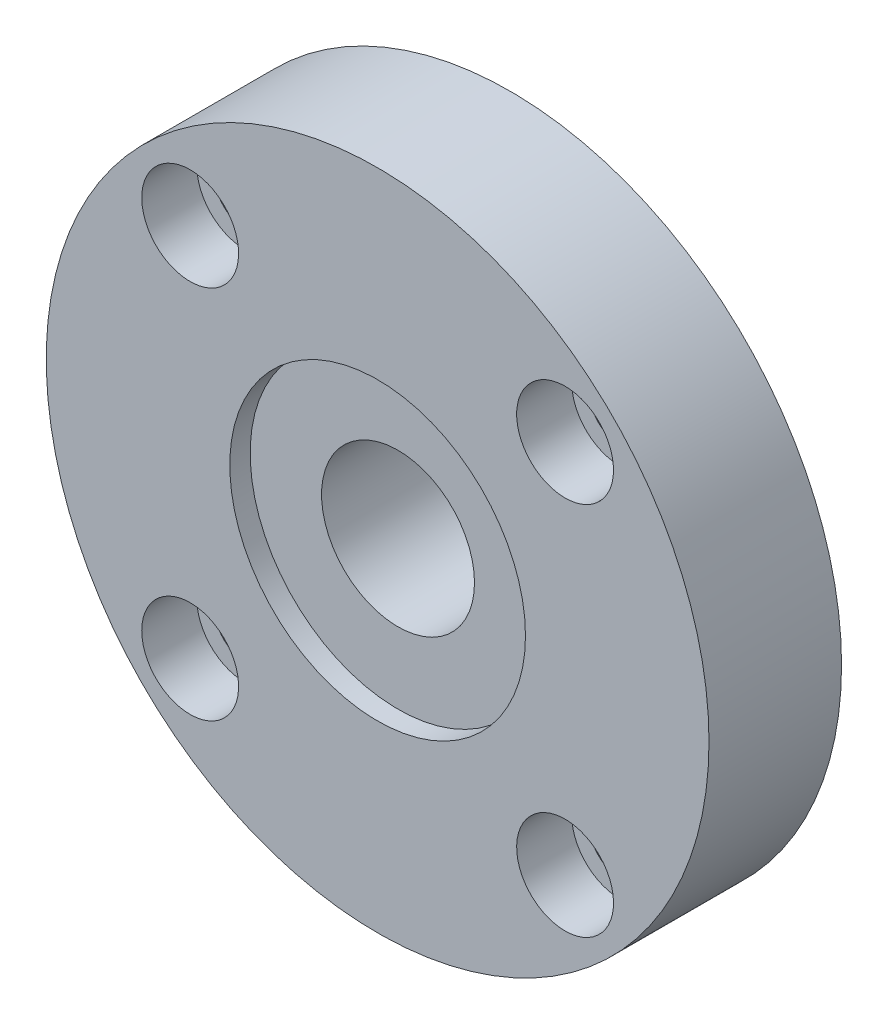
ISO-10303-21;
HEADER;
FILE_DESCRIPTION(('STEP AP214'),'2;1');
FILE_NAME('part.step','',(''),(''),'','','');
FILE_SCHEMA(('AUTOMOTIVE_DESIGN { 1 0 10303 214 1 1 1 1 }'));
ENDSEC;
DATA;
#1=APPLICATION_CONTEXT('core data for automotive mechanical design processes');
#2=APPLICATION_PROTOCOL_DEFINITION('international standard','automotive_design',2000,#1);
#3=PRODUCT_CONTEXT('',#1,'mechanical');
#4=PRODUCT('Part','Part','',(#3));
#5=PRODUCT_RELATED_PRODUCT_CATEGORY('part','',(#4));
#6=PRODUCT_DEFINITION_FORMATION('','',#4);
#7=PRODUCT_DEFINITION_CONTEXT('part definition',#1,'design');
#8=PRODUCT_DEFINITION('design','',#6,#7);
#9=PRODUCT_DEFINITION_SHAPE('','',#8);
#10=(LENGTH_UNIT() NAMED_UNIT(*) SI_UNIT(.MILLI.,.METRE.));
#11=(NAMED_UNIT(*) PLANE_ANGLE_UNIT() SI_UNIT($,.RADIAN.));
#12=(NAMED_UNIT(*) SI_UNIT($,.STERADIAN.) SOLID_ANGLE_UNIT());
#13=UNCERTAINTY_MEASURE_WITH_UNIT(LENGTH_MEASURE(1.E-05),#10,'distance_accuracy_value','');
#14=(GEOMETRIC_REPRESENTATION_CONTEXT(3) GLOBAL_UNCERTAINTY_ASSIGNED_CONTEXT((#13)) GLOBAL_UNIT_ASSIGNED_CONTEXT((#10,
#11,#12)) REPRESENTATION_CONTEXT('',''));
#15=CARTESIAN_POINT('',(0.,0.,0.));
#16=DIRECTION('',(0.,0.,1.));
#17=DIRECTION('',(1.,0.,0.));
#18=AXIS2_PLACEMENT_3D('',#15,#16,#17);
#19=CARTESIAN_POINT('',(0.,0.,13.));
#20=DIRECTION('',(0.,0.,-1.));
#21=DIRECTION('',(-1.,0.,0.));
#22=AXIS2_PLACEMENT_3D('',#19,#20,#21);
#23=CYLINDRICAL_SURFACE('',#22,7.5);
#24=CARTESIAN_POINT('',(0.,0.,0.));
#25=DIRECTION('',(0.,0.,1.));
#26=DIRECTION('',(1.,0.,0.));
#27=AXIS2_PLACEMENT_3D('',#24,#25,#26);
#28=CIRCLE('',#27,7.5);
#29=CARTESIAN_POINT('',(7.5,0.,0.));
#30=VERTEX_POINT('',#29);
#31=EDGE_CURVE('E25',#30,#30,#28,.T.);
#32=ORIENTED_EDGE('',*,*,#31,.F.);
#33=EDGE_LOOP('',(#32));
#34=FACE_BOUND('',#33,.T.);
#35=CARTESIAN_POINT('',(0.,0.,11.));
#36=DIRECTION('',(0.,0.,1.));
#37=DIRECTION('',(1.,0.,0.));
#38=AXIS2_PLACEMENT_3D('',#35,#36,#37);
#39=CIRCLE('',#38,7.5);
#40=CARTESIAN_POINT('',(7.5,0.,11.));
#41=VERTEX_POINT('',#40);
#42=EDGE_CURVE('E16',#41,#41,#39,.T.);
#43=ORIENTED_EDGE('',*,*,#42,.T.);
#44=EDGE_LOOP('',(#43));
#45=FACE_BOUND('',#44,.T.);
#46=ADVANCED_FACE('F12',(#34,#45),#23,.F.);
#47=CARTESIAN_POINT('',(-18.38477631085,18.3847763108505,0.));
#48=DIRECTION('',(0.,0.,1.));
#49=DIRECTION('',(1.,0.,0.));
#50=AXIS2_PLACEMENT_3D('',#47,#48,#49);
#51=CYLINDRICAL_SURFACE('',#50,3.);
#52=CARTESIAN_POINT('',(-18.38477631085,18.3847763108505,0.));
#53=DIRECTION('',(0.,0.,1.));
#54=DIRECTION('',(0.,1.,0.));
#55=AXIS2_PLACEMENT_3D('',#52,#53,#54);
#56=CIRCLE('',#55,3.);
#57=CARTESIAN_POINT('',(-18.38477631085,21.3847763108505,0.));
#58=VERTEX_POINT('',#57);
#59=EDGE_CURVE('E37',#58,#58,#56,.T.);
#60=ORIENTED_EDGE('',*,*,#59,.F.);
#61=EDGE_LOOP('',(#60));
#62=FACE_BOUND('',#61,.T.);
#63=CARTESIAN_POINT('',(-18.38477631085,18.3847763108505,7.6));
#64=DIRECTION('',(0.,0.,1.));
#65=DIRECTION('',(1.,0.,0.));
#66=AXIS2_PLACEMENT_3D('',#63,#64,#65);
#67=CIRCLE('',#66,3.);
#68=CARTESIAN_POINT('',(-15.38477631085,18.3847763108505,7.6));
#69=VERTEX_POINT('',#68);
#70=EDGE_CURVE('E43',#69,#69,#67,.F.);
#71=ORIENTED_EDGE('',*,*,#70,.F.);
#72=EDGE_LOOP('',(#71));
#73=FACE_BOUND('',#72,.T.);
#74=ADVANCED_FACE('F87',(#62,#73),#51,.F.);
#75=CARTESIAN_POINT('',(-18.3847763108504,-18.3847763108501,0.));
#76=DIRECTION('',(0.,0.,1.));
#77=DIRECTION('',(1.,0.,0.));
#78=AXIS2_PLACEMENT_3D('',#75,#76,#77);
#79=CYLINDRICAL_SURFACE('',#78,3.);
#80=CARTESIAN_POINT('',(-18.3847763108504,-18.3847763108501,0.));
#81=DIRECTION('',(0.,0.,1.));
#82=DIRECTION('',(-1.,0.,0.));
#83=AXIS2_PLACEMENT_3D('',#80,#81,#82);
#84=CIRCLE('',#83,3.);
#85=CARTESIAN_POINT('',(-21.3847763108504,-18.3847763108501,0.));
#86=VERTEX_POINT('',#85);
#87=EDGE_CURVE('E68',#86,#86,#84,.T.);
#88=ORIENTED_EDGE('',*,*,#87,.F.);
#89=EDGE_LOOP('',(#88));
#90=FACE_BOUND('',#89,.T.);
#91=CARTESIAN_POINT('',(-18.3847763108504,-18.3847763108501,7.6));
#92=DIRECTION('',(0.,0.,1.));
#93=DIRECTION('',(1.,0.,0.));
#94=AXIS2_PLACEMENT_3D('',#91,#92,#93);
#95=CIRCLE('',#94,3.);
#96=CARTESIAN_POINT('',(-15.3847763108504,-18.3847763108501,7.6));
#97=VERTEX_POINT('',#96);
#98=EDGE_CURVE('E39',#97,#97,#95,.F.);
#99=ORIENTED_EDGE('',*,*,#98,.F.);
#100=EDGE_LOOP('',(#99));
#101=FACE_BOUND('',#100,.T.);
#102=ADVANCED_FACE('F160',(#90,#101),#79,.F.);
#103=CARTESIAN_POINT('',(18.3847763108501,-18.3847763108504,0.));
#104=DIRECTION('',(0.,0.,1.));
#105=DIRECTION('',(1.,0.,0.));
#106=AXIS2_PLACEMENT_3D('',#103,#104,#105);
#107=CYLINDRICAL_SURFACE('',#106,3.);
#108=CARTESIAN_POINT('',(18.3847763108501,-18.3847763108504,0.));
#109=DIRECTION('',(0.,0.,1.));
#110=DIRECTION('',(0.,-1.,0.));
#111=AXIS2_PLACEMENT_3D('',#108,#109,#110);
#112=CIRCLE('',#111,3.);
#113=CARTESIAN_POINT('',(18.3847763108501,-21.3847763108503,0.));
#114=VERTEX_POINT('',#113);
#115=EDGE_CURVE('E71',#114,#114,#112,.T.);
#116=ORIENTED_EDGE('',*,*,#115,.F.);
#117=EDGE_LOOP('',(#116));
#118=FACE_BOUND('',#117,.T.);
#119=CARTESIAN_POINT('',(18.3847763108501,-18.3847763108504,7.6));
#120=DIRECTION('',(0.,0.,1.));
#121=DIRECTION('',(1.,0.,0.));
#122=AXIS2_PLACEMENT_3D('',#119,#120,#121);
#123=CIRCLE('',#122,3.);
#124=CARTESIAN_POINT('',(21.3847763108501,-18.3847763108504,7.6));
#125=VERTEX_POINT('',#124);
#126=EDGE_CURVE('E34',#125,#125,#123,.F.);
#127=ORIENTED_EDGE('',*,*,#126,.F.);
#128=EDGE_LOOP('',(#127));
#129=FACE_BOUND('',#128,.T.);
#130=ADVANCED_FACE('F135',(#118,#129),#107,.F.);
#131=CARTESIAN_POINT('',(18.3847763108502,18.3847763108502,0.));
#132=DIRECTION('',(0.,0.,1.));
#133=DIRECTION('',(1.,0.,0.));
#134=AXIS2_PLACEMENT_3D('',#131,#132,#133);
#135=CYLINDRICAL_SURFACE('',#134,3.);
#136=CARTESIAN_POINT('',(18.3847763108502,18.3847763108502,0.));
#137=DIRECTION('',(0.,0.,1.));
#138=DIRECTION('',(1.,0.,0.));
#139=AXIS2_PLACEMENT_3D('',#136,#137,#138);
#140=CIRCLE('',#139,3.);
#141=CARTESIAN_POINT('',(21.3847763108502,18.3847763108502,0.));
#142=VERTEX_POINT('',#141);
#143=EDGE_CURVE('E32',#142,#142,#140,.T.);
#144=ORIENTED_EDGE('',*,*,#143,.F.);
#145=EDGE_LOOP('',(#144));
#146=FACE_BOUND('',#145,.T.);
#147=CARTESIAN_POINT('',(18.3847763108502,18.3847763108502,7.6));
#148=DIRECTION('',(0.,0.,1.));
#149=DIRECTION('',(1.,0.,0.));
#150=AXIS2_PLACEMENT_3D('',#147,#148,#149);
#151=CIRCLE('',#150,3.);
#152=CARTESIAN_POINT('',(21.3847763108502,18.3847763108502,7.6));
#153=VERTEX_POINT('',#152);
#154=EDGE_CURVE('E29',#153,#153,#151,.F.);
#155=ORIENTED_EDGE('',*,*,#154,.F.);
#156=EDGE_LOOP('',(#155));
#157=FACE_BOUND('',#156,.T.);
#158=ADVANCED_FACE('F106',(#146,#157),#135,.F.);
#159=CARTESIAN_POINT('',(0.,0.,13.));
#160=DIRECTION('',(0.,0.,1.));
#161=DIRECTION('',(1.,0.,0.));
#162=AXIS2_PLACEMENT_3D('',#159,#160,#161);
#163=PLANE('',#162);
#164=CARTESIAN_POINT('',(0.,0.,13.));
#165=DIRECTION('',(0.,0.,1.));
#166=DIRECTION('',(1.,0.,0.));
#167=AXIS2_PLACEMENT_3D('',#164,#165,#166);
#168=CIRCLE('',#167,14.5);
#169=CARTESIAN_POINT('',(14.5,0.,13.));
#170=VERTEX_POINT('',#169);
#171=EDGE_CURVE('E94',#170,#170,#168,.T.);
#172=ORIENTED_EDGE('',*,*,#171,.F.);
#173=EDGE_LOOP('',(#172));
#174=FACE_BOUND('',#173,.T.);
#175=CARTESIAN_POINT('',(-18.38477631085,18.3847763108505,13.));
#176=DIRECTION('',(0.,0.,1.));
#177=DIRECTION('',(0.,1.,0.));
#178=AXIS2_PLACEMENT_3D('',#175,#176,#177);
#179=CIRCLE('',#178,4.75);
#180=CARTESIAN_POINT('',(-18.38477631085,23.1347763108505,13.));
#181=VERTEX_POINT('',#180);
#182=EDGE_CURVE('E52',#181,#181,#179,.T.);
#183=ORIENTED_EDGE('',*,*,#182,.F.);
#184=EDGE_LOOP('',(#183));
#185=FACE_BOUND('',#184,.T.);
#186=CARTESIAN_POINT('',(-18.3847763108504,-18.3847763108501,13.));
#187=DIRECTION('',(0.,0.,1.));
#188=DIRECTION('',(-1.,0.,0.));
#189=AXIS2_PLACEMENT_3D('',#186,#187,#188);
#190=CIRCLE('',#189,4.75);
#191=CARTESIAN_POINT('',(-23.1347763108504,-18.3847763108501,13.));
#192=VERTEX_POINT('',#191);
#193=EDGE_CURVE('E45',#192,#192,#190,.T.);
#194=ORIENTED_EDGE('',*,*,#193,.F.);
#195=EDGE_LOOP('',(#194));
#196=FACE_BOUND('',#195,.T.);
#197=CARTESIAN_POINT('',(18.3847763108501,-18.3847763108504,13.));
#198=DIRECTION('',(0.,0.,1.));
#199=DIRECTION('',(0.,-1.,0.));
#200=AXIS2_PLACEMENT_3D('',#197,#198,#199);
#201=CIRCLE('',#200,4.75);
#202=CARTESIAN_POINT('',(18.3847763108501,-23.1347763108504,13.));
#203=VERTEX_POINT('',#202);
#204=EDGE_CURVE('E41',#203,#203,#201,.T.);
#205=ORIENTED_EDGE('',*,*,#204,.F.);
#206=EDGE_LOOP('',(#205));
#207=FACE_BOUND('',#206,.T.);
#208=CARTESIAN_POINT('',(18.3847763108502,18.3847763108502,13.));
#209=DIRECTION('',(0.,0.,1.));
#210=DIRECTION('',(1.,0.,0.));
#211=AXIS2_PLACEMENT_3D('',#208,#209,#210);
#212=CIRCLE('',#211,4.75);
#213=CARTESIAN_POINT('',(23.1347763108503,18.3847763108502,13.));
#214=VERTEX_POINT('',#213);
#215=EDGE_CURVE('E74',#214,#214,#212,.T.);
#216=ORIENTED_EDGE('',*,*,#215,.F.);
#217=EDGE_LOOP('',(#216));
#218=FACE_BOUND('',#217,.T.);
#219=CARTESIAN_POINT('',(0.,0.,13.));
#220=DIRECTION('',(0.,0.,1.));
#221=DIRECTION('',(1.,0.,0.));
#222=AXIS2_PLACEMENT_3D('',#219,#220,#221);
#223=CIRCLE('',#222,32.5);
#224=CARTESIAN_POINT('',(32.5,0.,13.));
#225=VERTEX_POINT('',#224);
#226=EDGE_CURVE('E8',#225,#225,#223,.T.);
#227=ORIENTED_EDGE('',*,*,#226,.T.);
#228=EDGE_LOOP('',(#227));
#229=FACE_BOUND('',#228,.T.);
#230=ADVANCED_FACE('F103',(#174,#185,#196,#207,#218,#229),#163,.T.);
#231=CARTESIAN_POINT('',(0.,0.,0.));
#232=DIRECTION('',(0.,0.,1.));
#233=DIRECTION('',(1.,0.,0.));
#234=AXIS2_PLACEMENT_3D('',#231,#232,#233);
#235=PLANE('',#234);
#236=ORIENTED_EDGE('',*,*,#59,.T.);
#237=EDGE_LOOP('',(#236));
#238=FACE_BOUND('',#237,.T.);
#239=ORIENTED_EDGE('',*,*,#87,.T.);
#240=EDGE_LOOP('',(#239));
#241=FACE_BOUND('',#240,.T.);
#242=ORIENTED_EDGE('',*,*,#115,.T.);
#243=EDGE_LOOP('',(#242));
#244=FACE_BOUND('',#243,.T.);
#245=ORIENTED_EDGE('',*,*,#143,.T.);
#246=EDGE_LOOP('',(#245));
#247=FACE_BOUND('',#246,.T.);
#248=CARTESIAN_POINT('',(0.,0.,0.));
#249=DIRECTION('',(0.,0.,1.));
#250=DIRECTION('',(1.,0.,0.));
#251=AXIS2_PLACEMENT_3D('',#248,#249,#250);
#252=CIRCLE('',#251,32.5);
#253=CARTESIAN_POINT('',(32.5,0.,0.));
#254=VERTEX_POINT('',#253);
#255=EDGE_CURVE('E20',#254,#254,#252,.T.);
#256=ORIENTED_EDGE('',*,*,#255,.F.);
#257=EDGE_LOOP('',(#256));
#258=FACE_BOUND('',#257,.T.);
#259=ORIENTED_EDGE('',*,*,#31,.T.);
#260=EDGE_LOOP('',(#259));
#261=FACE_BOUND('',#260,.T.);
#262=ADVANCED_FACE('F83',(#238,#241,#244,#247,#258,#261),#235,.F.);
#263=CARTESIAN_POINT('',(0.,0.,13.));
#264=DIRECTION('',(0.,0.,-1.));
#265=DIRECTION('',(-1.,0.,0.));
#266=AXIS2_PLACEMENT_3D('',#263,#264,#265);
#267=CYLINDRICAL_SURFACE('',#266,32.5);
#268=ORIENTED_EDGE('',*,*,#226,.F.);
#269=EDGE_LOOP('',(#268));
#270=FACE_BOUND('',#269,.T.);
#271=ORIENTED_EDGE('',*,*,#255,.T.);
#272=EDGE_LOOP('',(#271));
#273=FACE_BOUND('',#272,.T.);
#274=ADVANCED_FACE('F14',(#270,#273),#267,.T.);
#275=CARTESIAN_POINT('',(18.3847763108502,18.3847763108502,7.6));
#276=DIRECTION('',(0.,0.,1.));
#277=DIRECTION('',(1.,0.,0.));
#278=AXIS2_PLACEMENT_3D('',#275,#276,#277);
#279=PLANE('',#278);
#280=CARTESIAN_POINT('',(18.3847763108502,18.3847763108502,7.6));
#281=DIRECTION('',(0.,0.,1.));
#282=DIRECTION('',(1.,0.,0.));
#283=AXIS2_PLACEMENT_3D('',#280,#281,#282);
#284=CIRCLE('',#283,4.75);
#285=CARTESIAN_POINT('',(23.1347763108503,18.3847763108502,7.6));
#286=VERTEX_POINT('',#285);
#287=EDGE_CURVE('E33',#286,#286,#284,.T.);
#288=ORIENTED_EDGE('',*,*,#287,.T.);
#289=EDGE_LOOP('',(#288));
#290=FACE_BOUND('',#289,.T.);
#291=ORIENTED_EDGE('',*,*,#154,.T.);
#292=EDGE_LOOP('',(#291));
#293=FACE_BOUND('',#292,.T.);
#294=ADVANCED_FACE('F118',(#290,#293),#279,.T.);
#295=CARTESIAN_POINT('',(18.3847763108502,18.3847763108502,7.6));
#296=DIRECTION('',(0.,0.,1.));
#297=DIRECTION('',(1.,0.,0.));
#298=AXIS2_PLACEMENT_3D('',#295,#296,#297);
#299=CYLINDRICAL_SURFACE('',#298,4.75);
#300=ORIENTED_EDGE('',*,*,#287,.F.);
#301=EDGE_LOOP('',(#300));
#302=FACE_BOUND('',#301,.T.);
#303=ORIENTED_EDGE('',*,*,#215,.T.);
#304=EDGE_LOOP('',(#303));
#305=FACE_BOUND('',#304,.T.);
#306=ADVANCED_FACE('F115',(#302,#305),#299,.F.);
#307=CARTESIAN_POINT('',(18.3847763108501,-18.3847763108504,7.6));
#308=DIRECTION('',(0.,0.,1.));
#309=DIRECTION('',(0.,-1.,0.));
#310=AXIS2_PLACEMENT_3D('',#307,#308,#309);
#311=PLANE('',#310);
#312=CARTESIAN_POINT('',(18.3847763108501,-18.3847763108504,7.6));
#313=DIRECTION('',(0.,0.,1.));
#314=DIRECTION('',(0.,-1.,0.));
#315=AXIS2_PLACEMENT_3D('',#312,#313,#314);
#316=CIRCLE('',#315,4.75);
#317=CARTESIAN_POINT('',(18.3847763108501,-23.1347763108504,7.6));
#318=VERTEX_POINT('',#317);
#319=EDGE_CURVE('E38',#318,#318,#316,.T.);
#320=ORIENTED_EDGE('',*,*,#319,.T.);
#321=EDGE_LOOP('',(#320));
#322=FACE_BOUND('',#321,.T.);
#323=ORIENTED_EDGE('',*,*,#126,.T.);
#324=EDGE_LOOP('',(#323));
#325=FACE_BOUND('',#324,.T.);
#326=ADVANCED_FACE('F117',(#322,#325),#311,.T.);
#327=CARTESIAN_POINT('',(18.3847763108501,-18.3847763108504,7.6));
#328=DIRECTION('',(0.,0.,1.));
#329=DIRECTION('',(1.,0.,0.));
#330=AXIS2_PLACEMENT_3D('',#327,#328,#329);
#331=CYLINDRICAL_SURFACE('',#330,4.75);
#332=ORIENTED_EDGE('',*,*,#319,.F.);
#333=EDGE_LOOP('',(#332));
#334=FACE_BOUND('',#333,.T.);
#335=ORIENTED_EDGE('',*,*,#204,.T.);
#336=EDGE_LOOP('',(#335));
#337=FACE_BOUND('',#336,.T.);
#338=ADVANCED_FACE('F126',(#334,#337),#331,.F.);
#339=CARTESIAN_POINT('',(-18.3847763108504,-18.3847763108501,7.6));
#340=DIRECTION('',(0.,0.,1.));
#341=DIRECTION('',(-1.,0.,0.));
#342=AXIS2_PLACEMENT_3D('',#339,#340,#341);
#343=PLANE('',#342);
#344=CARTESIAN_POINT('',(-18.3847763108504,-18.3847763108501,7.6));
#345=DIRECTION('',(0.,0.,1.));
#346=DIRECTION('',(-1.,0.,0.));
#347=AXIS2_PLACEMENT_3D('',#344,#345,#346);
#348=CIRCLE('',#347,4.75);
#349=CARTESIAN_POINT('',(-23.1347763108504,-18.3847763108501,7.6));
#350=VERTEX_POINT('',#349);
#351=EDGE_CURVE('E42',#350,#350,#348,.T.);
#352=ORIENTED_EDGE('',*,*,#351,.T.);
#353=EDGE_LOOP('',(#352));
#354=FACE_BOUND('',#353,.T.);
#355=ORIENTED_EDGE('',*,*,#98,.T.);
#356=EDGE_LOOP('',(#355));
#357=FACE_BOUND('',#356,.T.);
#358=ADVANCED_FACE('F173',(#354,#357),#343,.T.);
#359=CARTESIAN_POINT('',(-18.3847763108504,-18.3847763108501,7.6));
#360=DIRECTION('',(0.,0.,1.));
#361=DIRECTION('',(1.,0.,0.));
#362=AXIS2_PLACEMENT_3D('',#359,#360,#361);
#363=CYLINDRICAL_SURFACE('',#362,4.75);
#364=ORIENTED_EDGE('',*,*,#351,.F.);
#365=EDGE_LOOP('',(#364));
#366=FACE_BOUND('',#365,.T.);
#367=ORIENTED_EDGE('',*,*,#193,.T.);
#368=EDGE_LOOP('',(#367));
#369=FACE_BOUND('',#368,.T.);
#370=ADVANCED_FACE('F176',(#366,#369),#363,.F.);
#371=CARTESIAN_POINT('',(-18.38477631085,18.3847763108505,7.6));
#372=DIRECTION('',(0.,0.,1.));
#373=DIRECTION('',(0.,1.,0.));
#374=AXIS2_PLACEMENT_3D('',#371,#372,#373);
#375=PLANE('',#374);
#376=CARTESIAN_POINT('',(-18.38477631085,18.3847763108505,7.6));
#377=DIRECTION('',(0.,0.,1.));
#378=DIRECTION('',(0.,1.,0.));
#379=AXIS2_PLACEMENT_3D('',#376,#377,#378);
#380=CIRCLE('',#379,4.75);
#381=CARTESIAN_POINT('',(-18.38477631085,23.1347763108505,7.6));
#382=VERTEX_POINT('',#381);
#383=EDGE_CURVE('E46',#382,#382,#380,.T.);
#384=ORIENTED_EDGE('',*,*,#383,.T.);
#385=EDGE_LOOP('',(#384));
#386=FACE_BOUND('',#385,.T.);
#387=ORIENTED_EDGE('',*,*,#70,.T.);
#388=EDGE_LOOP('',(#387));
#389=FACE_BOUND('',#388,.T.);
#390=ADVANCED_FACE('F179',(#386,#389),#375,.T.);
#391=CARTESIAN_POINT('',(-18.38477631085,18.3847763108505,7.6));
#392=DIRECTION('',(0.,0.,1.));
#393=DIRECTION('',(1.,0.,0.));
#394=AXIS2_PLACEMENT_3D('',#391,#392,#393);
#395=CYLINDRICAL_SURFACE('',#394,4.75);
#396=ORIENTED_EDGE('',*,*,#383,.F.);
#397=EDGE_LOOP('',(#396));
#398=FACE_BOUND('',#397,.T.);
#399=ORIENTED_EDGE('',*,*,#182,.T.);
#400=EDGE_LOOP('',(#399));
#401=FACE_BOUND('',#400,.T.);
#402=ADVANCED_FACE('F184',(#398,#401),#395,.F.);
#403=CARTESIAN_POINT('',(0.,0.,11.));
#404=DIRECTION('',(0.,0.,1.));
#405=DIRECTION('',(1.,0.,0.));
#406=AXIS2_PLACEMENT_3D('',#403,#404,#405);
#407=CYLINDRICAL_SURFACE('',#406,14.5);
#408=CARTESIAN_POINT('',(0.,0.,11.));
#409=DIRECTION('',(0.,0.,1.));
#410=DIRECTION('',(1.,0.,0.));
#411=AXIS2_PLACEMENT_3D('',#408,#409,#410);
#412=CIRCLE('',#411,14.5);
#413=CARTESIAN_POINT('',(14.5,0.,11.));
#414=VERTEX_POINT('',#413);
#415=EDGE_CURVE('E92',#414,#414,#412,.T.);
#416=ORIENTED_EDGE('',*,*,#415,.F.);
#417=EDGE_LOOP('',(#416));
#418=FACE_BOUND('',#417,.T.);
#419=ORIENTED_EDGE('',*,*,#171,.T.);
#420=EDGE_LOOP('',(#419));
#421=FACE_BOUND('',#420,.T.);
#422=ADVANCED_FACE('F101',(#418,#421),#407,.F.);
#423=CARTESIAN_POINT('',(0.,0.,11.));
#424=DIRECTION('',(0.,0.,1.));
#425=DIRECTION('',(1.,0.,0.));
#426=AXIS2_PLACEMENT_3D('',#423,#424,#425);
#427=PLANE('',#426);
#428=ORIENTED_EDGE('',*,*,#42,.F.);
#429=EDGE_LOOP('',(#428));
#430=FACE_BOUND('',#429,.T.);
#431=ORIENTED_EDGE('',*,*,#415,.T.);
#432=EDGE_LOOP('',(#431));
#433=FACE_BOUND('',#432,.T.);
#434=ADVANCED_FACE('F188',(#430,#433),#427,.T.);
#435=CLOSED_SHELL('',(#46,#74,#102,#130,#158,#230,#262,#274,#294,#306,#326,#338,#358,#370,#390,
#402,#422,#434));
#436=MANIFOLD_SOLID_BREP('B1',#435);
#437=ADVANCED_BREP_SHAPE_REPRESENTATION('',(#18,#436),#14);
#438=SHAPE_DEFINITION_REPRESENTATION(#9,#437);
ENDSEC;
END-ISO-10303-21;
